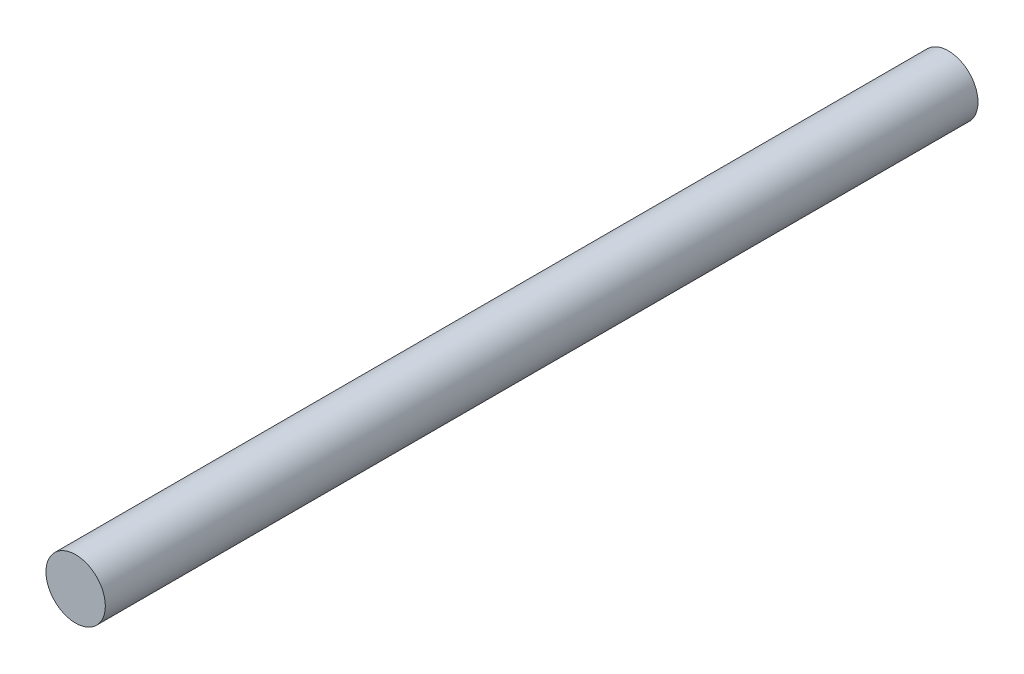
ISO-10303-21;
HEADER;
FILE_DESCRIPTION(('STEP AP214'),'2;1');
FILE_NAME('part.step','',(''),(''),'','','');
FILE_SCHEMA(('AUTOMOTIVE_DESIGN { 1 0 10303 214 1 1 1 1 }'));
ENDSEC;
DATA;
#1=APPLICATION_CONTEXT('core data for automotive mechanical design processes');
#2=APPLICATION_PROTOCOL_DEFINITION('international standard','automotive_design',2000,#1);
#3=PRODUCT_CONTEXT('',#1,'mechanical');
#4=PRODUCT('Part','Part','',(#3));
#5=PRODUCT_RELATED_PRODUCT_CATEGORY('part','',(#4));
#6=PRODUCT_DEFINITION_FORMATION('','',#4);
#7=PRODUCT_DEFINITION_CONTEXT('part definition',#1,'design');
#8=PRODUCT_DEFINITION('design','',#6,#7);
#9=PRODUCT_DEFINITION_SHAPE('','',#8);
#10=(LENGTH_UNIT() NAMED_UNIT(*) SI_UNIT(.MILLI.,.METRE.));
#11=(NAMED_UNIT(*) PLANE_ANGLE_UNIT() SI_UNIT($,.RADIAN.));
#12=(NAMED_UNIT(*) SI_UNIT($,.STERADIAN.) SOLID_ANGLE_UNIT());
#13=UNCERTAINTY_MEASURE_WITH_UNIT(LENGTH_MEASURE(1.E-05),#10,'distance_accuracy_value','');
#14=(GEOMETRIC_REPRESENTATION_CONTEXT(3) GLOBAL_UNCERTAINTY_ASSIGNED_CONTEXT((#13)) GLOBAL_UNIT_ASSIGNED_CONTEXT((#10,
#11,#12)) REPRESENTATION_CONTEXT('',''));
#15=CARTESIAN_POINT('',(0.,0.,0.));
#16=DIRECTION('',(0.,0.,1.));
#17=DIRECTION('',(1.,0.,0.));
#18=AXIS2_PLACEMENT_3D('',#15,#16,#17);
#19=CARTESIAN_POINT('',(41.8723250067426,63.5844415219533,110.9153426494));
#20=DIRECTION('',(0.,0.,1.));
#21=DIRECTION('',(1.,0.,0.));
#22=AXIS2_PLACEMENT_3D('',#19,#20,#21);
#23=PLANE('',#22);
#24=CARTESIAN_POINT('',(41.8723250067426,57.8111413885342,110.9153426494));
#25=DIRECTION('',(0.,0.,1.));
#26=DIRECTION('',(1.,0.,0.));
#27=AXIS2_PLACEMENT_3D('',#24,#25,#26);
#28=CIRCLE('',#27,5.77330013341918);
#29=CARTESIAN_POINT('',(47.6456251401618,57.8111413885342,110.9153426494));
#30=VERTEX_POINT('',#29);
#31=EDGE_CURVE('E63',#30,#30,#28,.T.);
#32=ORIENTED_EDGE('',*,*,#31,.F.);
#33=EDGE_LOOP('',(#32));
#34=FACE_BOUND('',#33,.T.);
#35=CARTESIAN_POINT('',(41.8723250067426,57.8111413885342,110.9153426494));
#36=DIRECTION('',(0.,0.,1.));
#37=DIRECTION('',(1.,0.,0.));
#38=AXIS2_PLACEMENT_3D('',#35,#36,#37);
#39=CIRCLE('',#38,3.00000000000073);
#40=CARTESIAN_POINT('',(44.8723250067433,57.8111413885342,110.9153426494));
#41=VERTEX_POINT('',#40);
#42=EDGE_CURVE('E11',#41,#41,#39,.T.);
#43=ORIENTED_EDGE('',*,*,#42,.T.);
#44=EDGE_LOOP('',(#43));
#45=FACE_BOUND('',#44,.T.);
#46=ADVANCED_FACE('F37',(#34,#45),#23,.F.);
#47=CARTESIAN_POINT('',(41.8723250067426,57.8111413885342,280.6153426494));
#48=DIRECTION('',(0.,0.,1.));
#49=DIRECTION('',(1.,0.,0.));
#50=AXIS2_PLACEMENT_3D('',#47,#48,#49);
#51=CYLINDRICAL_SURFACE('',#50,3.00000000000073);
#52=ORIENTED_EDGE('',*,*,#42,.F.);
#53=EDGE_LOOP('',(#52));
#54=FACE_BOUND('',#53,.T.);
#55=CARTESIAN_POINT('',(41.8723250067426,57.8111413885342,177.1153426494));
#56=DIRECTION('',(0.,0.,1.));
#57=DIRECTION('',(1.,0.,0.));
#58=AXIS2_PLACEMENT_3D('',#55,#56,#57);
#59=CIRCLE('',#58,3.00000000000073);
#60=CARTESIAN_POINT('',(38.8756208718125,57.6705557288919,177.1153426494));
#61=VERTEX_POINT('',#60);
#62=CARTESIAN_POINT('',(44.8690291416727,57.6705557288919,177.1153426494));
#63=VERTEX_POINT('',#62);
#64=EDGE_CURVE('E44',#61,#63,#59,.T.);
#65=ORIENTED_EDGE('',*,*,#64,.T.);
#66=EDGE_CURVE('E64',#63,#61,#59,.T.);
#67=ORIENTED_EDGE('',*,*,#66,.T.);
#68=EDGE_LOOP('',(#65,#67));
#69=FACE_BOUND('',#68,.T.);
#70=ADVANCED_FACE('F68',(#54,#69),#51,.F.);
#71=CARTESIAN_POINT('',(41.8723250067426,60.8111413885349,177.1153426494));
#72=DIRECTION('',(0.,0.,1.));
#73=DIRECTION('',(1.,0.,0.));
#74=AXIS2_PLACEMENT_3D('',#71,#72,#73);
#75=PLANE('',#74);
#76=ORIENTED_EDGE('',*,*,#66,.F.);
#77=CARTESIAN_POINT('',(41.8723250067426,57.5299700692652,177.1153426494));
#78=DIRECTION('',(0.,0.,1.));
#79=DIRECTION('',(1.,0.,0.));
#80=AXIS2_PLACEMENT_3D('',#77,#78,#79);
#81=CIRCLE('',#80,3.);
#82=EDGE_CURVE('E56',#63,#61,#81,.T.);
#83=ORIENTED_EDGE('',*,*,#82,.T.);
#84=EDGE_LOOP('',(#76,#83));
#85=FACE_BOUND('',#84,.T.);
#86=ADVANCED_FACE('F65',(#85),#75,.F.);
#87=CARTESIAN_POINT('',(41.8723250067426,63.5844415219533,280.6153426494));
#88=DIRECTION('',(0.,0.,-1.));
#89=DIRECTION('',(-1.,0.,0.));
#90=AXIS2_PLACEMENT_3D('',#87,#88,#89);
#91=PLANE('',#90);
#92=CARTESIAN_POINT('',(41.8723250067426,57.8111413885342,280.6153426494));
#93=DIRECTION('',(0.,0.,1.));
#94=DIRECTION('',(1.,0.,0.));
#95=AXIS2_PLACEMENT_3D('',#92,#93,#94);
#96=CIRCLE('',#95,5.77330013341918);
#97=CARTESIAN_POINT('',(47.6456251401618,57.8111413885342,280.6153426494));
#98=VERTEX_POINT('',#97);
#99=EDGE_CURVE('E67',#98,#98,#96,.T.);
#100=ORIENTED_EDGE('',*,*,#99,.T.);
#101=EDGE_LOOP('',(#100));
#102=FACE_BOUND('',#101,.T.);
#103=ADVANCED_FACE('F102',(#102),#91,.F.);
#104=CARTESIAN_POINT('',(41.8723250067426,57.8111413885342,280.6153426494));
#105=DIRECTION('',(0.,0.,1.));
#106=DIRECTION('',(1.,0.,0.));
#107=AXIS2_PLACEMENT_3D('',#104,#105,#106);
#108=CYLINDRICAL_SURFACE('',#107,5.77330013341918);
#109=ORIENTED_EDGE('',*,*,#99,.F.);
#110=EDGE_LOOP('',(#109));
#111=FACE_BOUND('',#110,.T.);
#112=ORIENTED_EDGE('',*,*,#31,.T.);
#113=EDGE_LOOP('',(#112));
#114=FACE_BOUND('',#113,.T.);
#115=ADVANCED_FACE('F100',(#111,#114),#108,.T.);
#116=CARTESIAN_POINT('',(41.8723250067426,57.5299700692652,177.1153426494));
#117=DIRECTION('',(0.,0.,1.));
#118=DIRECTION('',(1.,0.,0.));
#119=AXIS2_PLACEMENT_3D('',#116,#117,#118);
#120=PLANE('',#119);
#121=EDGE_CURVE('E50',#61,#63,#81,.T.);
#122=ORIENTED_EDGE('',*,*,#121,.T.);
#123=ORIENTED_EDGE('',*,*,#64,.F.);
#124=EDGE_LOOP('',(#122,#123));
#125=FACE_BOUND('',#124,.T.);
#126=ADVANCED_FACE('F53',(#125),#120,.T.);
#127=CARTESIAN_POINT('',(41.8723250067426,57.5299700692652,182.1153426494));
#128=DIRECTION('',(0.,0.,1.));
#129=DIRECTION('',(1.,0.,0.));
#130=AXIS2_PLACEMENT_3D('',#127,#128,#129);
#131=CYLINDRICAL_SURFACE('',#130,3.);
#132=CARTESIAN_POINT('',(41.8723250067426,57.5299700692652,180.6153426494));
#133=DIRECTION('',(0.,0.,1.));
#134=DIRECTION('',(1.,0.,0.));
#135=AXIS2_PLACEMENT_3D('',#132,#133,#134);
#136=CIRCLE('',#135,3.);
#137=CARTESIAN_POINT('',(44.8723250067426,57.5299700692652,180.6153426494));
#138=VERTEX_POINT('',#137);
#139=EDGE_CURVE('E57',#138,#138,#136,.T.);
#140=ORIENTED_EDGE('',*,*,#139,.T.);
#141=EDGE_LOOP('',(#140));
#142=FACE_BOUND('',#141,.T.);
#143=ORIENTED_EDGE('',*,*,#82,.F.);
#144=ORIENTED_EDGE('',*,*,#121,.F.);
#145=EDGE_LOOP('',(#143,#144));
#146=FACE_BOUND('',#145,.T.);
#147=ADVANCED_FACE('F60',(#142,#146),#131,.F.);
#148=CARTESIAN_POINT('',(41.8723250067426,57.5299700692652,180.6153426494));
#149=DIRECTION('',(0.,0.,1.));
#150=DIRECTION('',(1.,0.,0.));
#151=AXIS2_PLACEMENT_3D('',#148,#149,#150);
#152=DEGENERATE_TOROIDAL_SURFACE('',#151,1.5,1.5,.T.);
#153=CARTESIAN_POINT('',(41.8723250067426,57.5299700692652,182.1153426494));
#154=DIRECTION('',(0.,0.,1.));
#155=DIRECTION('',(1.,0.,0.));
#156=AXIS2_PLACEMENT_3D('',#153,#154,#155);
#157=CIRCLE('',#156,1.5);
#158=CARTESIAN_POINT('',(43.3723250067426,57.5299700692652,182.1153426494));
#159=VERTEX_POINT('',#158);
#160=EDGE_CURVE('E76',#159,#159,#157,.T.);
#161=ORIENTED_EDGE('',*,*,#160,.T.);
#162=EDGE_LOOP('',(#161));
#163=FACE_BOUND('',#162,.T.);
#164=ORIENTED_EDGE('',*,*,#139,.F.);
#165=EDGE_LOOP('',(#164));
#166=FACE_BOUND('',#165,.T.);
#167=ADVANCED_FACE('F80',(#163,#166),#152,.F.);
#168=CARTESIAN_POINT('',(41.8723250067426,59.0299700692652,182.1153426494));
#169=DIRECTION('',(0.,0.,-1.));
#170=DIRECTION('',(-1.,0.,0.));
#171=AXIS2_PLACEMENT_3D('',#168,#169,#170);
#172=PLANE('',#171);
#173=ORIENTED_EDGE('',*,*,#160,.F.);
#174=EDGE_LOOP('',(#173));
#175=FACE_BOUND('',#174,.T.);
#176=ADVANCED_FACE('F83',(#175),#172,.T.);
#177=CLOSED_SHELL('',(#46,#70,#86,#103,#115,#126,#147,#167,#176));
#178=MANIFOLD_SOLID_BREP('B2',#177);
#179=ADVANCED_BREP_SHAPE_REPRESENTATION('',(#18,#178),#14);
#180=SHAPE_DEFINITION_REPRESENTATION(#9,#179);
ENDSEC;
END-ISO-10303-21;
